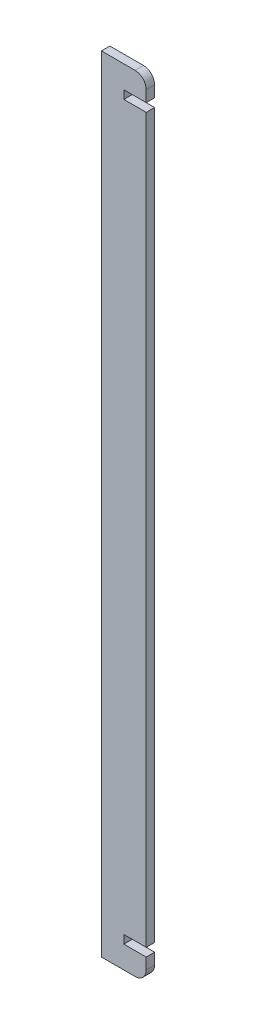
ISO-10303-21;
HEADER;
FILE_DESCRIPTION(('STEP AP214'),'2;1');
FILE_NAME('part.step','',(''),(''),'','','');
FILE_SCHEMA(('AUTOMOTIVE_DESIGN { 1 0 10303 214 1 1 1 1 }'));
ENDSEC;
DATA;
#1=APPLICATION_CONTEXT('core data for automotive mechanical design processes');
#2=APPLICATION_PROTOCOL_DEFINITION('international standard','automotive_design',2000,#1);
#3=PRODUCT_CONTEXT('',#1,'mechanical');
#4=PRODUCT('Part','Part','',(#3));
#5=PRODUCT_RELATED_PRODUCT_CATEGORY('part','',(#4));
#6=PRODUCT_DEFINITION_FORMATION('','',#4);
#7=PRODUCT_DEFINITION_CONTEXT('part definition',#1,'design');
#8=PRODUCT_DEFINITION('design','',#6,#7);
#9=PRODUCT_DEFINITION_SHAPE('','',#8);
#10=(LENGTH_UNIT() NAMED_UNIT(*) SI_UNIT(.MILLI.,.METRE.));
#11=(NAMED_UNIT(*) PLANE_ANGLE_UNIT() SI_UNIT($,.RADIAN.));
#12=(NAMED_UNIT(*) SI_UNIT($,.STERADIAN.) SOLID_ANGLE_UNIT());
#13=UNCERTAINTY_MEASURE_WITH_UNIT(LENGTH_MEASURE(1.E-05),#10,'distance_accuracy_value','');
#14=(GEOMETRIC_REPRESENTATION_CONTEXT(3) GLOBAL_UNCERTAINTY_ASSIGNED_CONTEXT((#13)) GLOBAL_UNIT_ASSIGNED_CONTEXT((#10,
#11,#12)) REPRESENTATION_CONTEXT('',''));
#15=CARTESIAN_POINT('',(0.,0.,0.));
#16=DIRECTION('',(0.,0.,1.));
#17=DIRECTION('',(1.,0.,0.));
#18=AXIS2_PLACEMENT_3D('',#15,#16,#17);
#19=CARTESIAN_POINT('',(50.7999999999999,889.,19.05));
#20=DIRECTION('',(1.,0.,0.));
#21=DIRECTION('',(0.,1.,0.));
#22=AXIS2_PLACEMENT_3D('',#19,#20,#21);
#23=PLANE('',#22);
#24=DIRECTION('',(0.,-1.,0.));
#25=VECTOR('',#24,1.);
#26=CARTESIAN_POINT('',(50.7999999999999,889.,19.05));
#27=LINE('',#26,#25);
#28=CARTESIAN_POINT('',(50.7999999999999,-838.2,19.05));
#29=VERTEX_POINT('',#28);
#30=CARTESIAN_POINT('',(50.8000000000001,-863.6,19.05));
#31=VERTEX_POINT('',#30);
#32=EDGE_CURVE('E156',#29,#31,#27,.T.);
#33=ORIENTED_EDGE('',*,*,#32,.T.);
#34=DIRECTION('',(0.,0.,-1.));
#35=VECTOR('',#34,1.);
#36=CARTESIAN_POINT('',(50.8000000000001,-863.6,0.));
#37=LINE('',#36,#35);
#38=CARTESIAN_POINT('',(50.8000000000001,-863.6,0.));
#39=VERTEX_POINT('',#38);
#40=EDGE_CURVE('E41',#31,#39,#37,.T.);
#41=ORIENTED_EDGE('',*,*,#40,.T.);
#42=DIRECTION('',(0.,-1.,0.));
#43=VECTOR('',#42,1.);
#44=CARTESIAN_POINT('',(50.7999999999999,889.,0.));
#45=LINE('',#44,#43);
#46=CARTESIAN_POINT('',(50.7999999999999,-838.2,0.));
#47=VERTEX_POINT('',#46);
#48=EDGE_CURVE('E213',#47,#39,#45,.T.);
#49=ORIENTED_EDGE('',*,*,#48,.F.);
#50=DIRECTION('',(0.,0.,-1.));
#51=VECTOR('',#50,1.);
#52=CARTESIAN_POINT('',(50.7999999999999,-838.2,19.05));
#53=LINE('',#52,#51);
#54=EDGE_CURVE('E165',#29,#47,#53,.T.);
#55=ORIENTED_EDGE('',*,*,#54,.F.);
#56=EDGE_LOOP('',(#33,#41,#49,#55));
#57=FACE_BOUND('',#56,.T.);
#58=ADVANCED_FACE('F33',(#57),#23,.T.);
#59=CARTESIAN_POINT('',(50.7999999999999,863.6,0.));
#60=VERTEX_POINT('',#59);
#61=CARTESIAN_POINT('',(50.7999999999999,838.2,0.));
#62=VERTEX_POINT('',#61);
#63=EDGE_CURVE('E214',#60,#62,#45,.T.);
#64=ORIENTED_EDGE('',*,*,#63,.F.);
#65=DIRECTION('',(0.,0.,-1.));
#66=VECTOR('',#65,1.);
#67=CARTESIAN_POINT('',(50.7999999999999,863.6,19.05));
#68=LINE('',#67,#66);
#69=CARTESIAN_POINT('',(50.7999999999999,863.6,19.05));
#70=VERTEX_POINT('',#69);
#71=EDGE_CURVE('E231',#60,#70,#68,.F.);
#72=ORIENTED_EDGE('',*,*,#71,.T.);
#73=CARTESIAN_POINT('',(50.7999999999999,838.2,19.05));
#74=VERTEX_POINT('',#73);
#75=EDGE_CURVE('E203',#70,#74,#27,.T.);
#76=ORIENTED_EDGE('',*,*,#75,.T.);
#77=DIRECTION('',(0.,0.,-1.));
#78=VECTOR('',#77,1.);
#79=CARTESIAN_POINT('',(50.7999999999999,838.2,19.05));
#80=LINE('',#79,#78);
#81=EDGE_CURVE('E190',#74,#62,#80,.T.);
#82=ORIENTED_EDGE('',*,*,#81,.T.);
#83=EDGE_LOOP('',(#64,#72,#76,#82));
#84=FACE_BOUND('',#83,.T.);
#85=ADVANCED_FACE('F288',(#84),#23,.T.);
#86=CARTESIAN_POINT('',(-50.8000000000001,889.,19.05));
#87=DIRECTION('',(0.,1.,0.));
#88=DIRECTION('',(0.,0.,1.));
#89=AXIS2_PLACEMENT_3D('',#86,#87,#88);
#90=PLANE('',#89);
#91=DIRECTION('',(1.,0.,0.));
#92=VECTOR('',#91,1.);
#93=CARTESIAN_POINT('',(-50.8000000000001,889.,19.05));
#94=LINE('',#93,#92);
#95=CARTESIAN_POINT('',(-50.8000000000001,889.,19.05));
#96=VERTEX_POINT('',#95);
#97=CARTESIAN_POINT('',(25.3999999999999,889.,19.05));
#98=VERTEX_POINT('',#97);
#99=EDGE_CURVE('E199',#96,#98,#94,.T.);
#100=ORIENTED_EDGE('',*,*,#99,.T.);
#101=DIRECTION('',(0.,0.,-1.));
#102=VECTOR('',#101,1.);
#103=CARTESIAN_POINT('',(25.3999999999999,889.,19.05));
#104=LINE('',#103,#102);
#105=CARTESIAN_POINT('',(25.3999999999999,889.,0.));
#106=VERTEX_POINT('',#105);
#107=EDGE_CURVE('E222',#98,#106,#104,.T.);
#108=ORIENTED_EDGE('',*,*,#107,.T.);
#109=DIRECTION('',(1.,0.,0.));
#110=VECTOR('',#109,1.);
#111=CARTESIAN_POINT('',(-50.8000000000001,889.,0.));
#112=LINE('',#111,#110);
#113=CARTESIAN_POINT('',(-50.8000000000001,889.,0.));
#114=VERTEX_POINT('',#113);
#115=EDGE_CURVE('E193',#114,#106,#112,.T.);
#116=ORIENTED_EDGE('',*,*,#115,.F.);
#117=DIRECTION('',(0.,0.,-1.));
#118=VECTOR('',#117,1.);
#119=CARTESIAN_POINT('',(-50.8000000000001,889.,19.05));
#120=LINE('',#119,#118);
#121=EDGE_CURVE('E220',#96,#114,#120,.T.);
#122=ORIENTED_EDGE('',*,*,#121,.F.);
#123=EDGE_LOOP('',(#100,#108,#116,#122));
#124=FACE_BOUND('',#123,.T.);
#125=ADVANCED_FACE('F275',(#124),#90,.T.);
#126=CARTESIAN_POINT('',(-50.8000000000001,889.,19.05));
#127=DIRECTION('',(1.,0.,0.));
#128=DIRECTION('',(0.,1.,0.));
#129=AXIS2_PLACEMENT_3D('',#126,#127,#128);
#130=PLANE('',#129);
#131=DIRECTION('',(0.,-1.,0.));
#132=VECTOR('',#131,1.);
#133=CARTESIAN_POINT('',(-50.8000000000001,889.,0.));
#134=LINE('',#133,#132);
#135=CARTESIAN_POINT('',(-50.7999999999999,-889.,0.));
#136=VERTEX_POINT('',#135);
#137=EDGE_CURVE('E202',#114,#136,#134,.T.);
#138=ORIENTED_EDGE('',*,*,#137,.T.);
#139=DIRECTION('',(0.,0.,-1.));
#140=VECTOR('',#139,1.);
#141=CARTESIAN_POINT('',(-50.7999999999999,-889.,19.05));
#142=LINE('',#141,#140);
#143=CARTESIAN_POINT('',(-50.7999999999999,-889.,19.05));
#144=VERTEX_POINT('',#143);
#145=EDGE_CURVE('E210',#144,#136,#142,.T.);
#146=ORIENTED_EDGE('',*,*,#145,.F.);
#147=DIRECTION('',(0.,-1.,0.));
#148=VECTOR('',#147,1.);
#149=CARTESIAN_POINT('',(-50.8000000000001,889.,19.05));
#150=LINE('',#149,#148);
#151=EDGE_CURVE('E208',#96,#144,#150,.T.);
#152=ORIENTED_EDGE('',*,*,#151,.F.);
#153=ORIENTED_EDGE('',*,*,#121,.T.);
#154=EDGE_LOOP('',(#138,#146,#152,#153));
#155=FACE_BOUND('',#154,.T.);
#156=ADVANCED_FACE('F280',(#155),#130,.F.);
#157=CARTESIAN_POINT('',(-50.7999999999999,-889.,19.05));
#158=DIRECTION('',(0.,1.,0.));
#159=DIRECTION('',(0.,0.,1.));
#160=AXIS2_PLACEMENT_3D('',#157,#158,#159);
#161=PLANE('',#160);
#162=DIRECTION('',(1.,0.,0.));
#163=VECTOR('',#162,1.);
#164=CARTESIAN_POINT('',(-50.7999999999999,-889.,0.));
#165=LINE('',#164,#163);
#166=CARTESIAN_POINT('',(25.4000000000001,-889.,0.));
#167=VERTEX_POINT('',#166);
#168=EDGE_CURVE('E216',#136,#167,#165,.T.);
#169=ORIENTED_EDGE('',*,*,#168,.T.);
#170=DIRECTION('',(0.,0.,-1.));
#171=VECTOR('',#170,1.);
#172=CARTESIAN_POINT('',(25.4000000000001,-889.,19.05));
#173=LINE('',#172,#171);
#174=CARTESIAN_POINT('',(25.4000000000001,-889.,19.05));
#175=VERTEX_POINT('',#174);
#176=EDGE_CURVE('E11',#167,#175,#173,.F.);
#177=ORIENTED_EDGE('',*,*,#176,.T.);
#178=DIRECTION('',(1.,0.,0.));
#179=VECTOR('',#178,1.);
#180=CARTESIAN_POINT('',(-50.7999999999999,-889.,19.05));
#181=LINE('',#180,#179);
#182=EDGE_CURVE('E205',#144,#175,#181,.T.);
#183=ORIENTED_EDGE('',*,*,#182,.F.);
#184=ORIENTED_EDGE('',*,*,#145,.T.);
#185=EDGE_LOOP('',(#169,#177,#183,#184));
#186=FACE_BOUND('',#185,.T.);
#187=ADVANCED_FACE('F282',(#186),#161,.F.);
#188=DIRECTION('',(0.,0.,-1.));
#189=VECTOR('',#188,1.);
#190=CARTESIAN_POINT('',(50.7999999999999,-819.15,19.05));
#191=LINE('',#190,#189);
#192=CARTESIAN_POINT('',(50.7999999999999,-819.15,19.05));
#193=VERTEX_POINT('',#192);
#194=CARTESIAN_POINT('',(50.7999999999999,-819.15,0.));
#195=VERTEX_POINT('',#194);
#196=EDGE_CURVE('E168',#193,#195,#191,.T.);
#197=ORIENTED_EDGE('',*,*,#196,.T.);
#198=CARTESIAN_POINT('',(50.7999999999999,819.15,0.));
#199=VERTEX_POINT('',#198);
#200=EDGE_CURVE('E217',#199,#195,#45,.T.);
#201=ORIENTED_EDGE('',*,*,#200,.F.);
#202=DIRECTION('',(0.,0.,-1.));
#203=VECTOR('',#202,1.);
#204=CARTESIAN_POINT('',(50.7999999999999,819.15,19.05));
#205=LINE('',#204,#203);
#206=CARTESIAN_POINT('',(50.7999999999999,819.15,19.05));
#207=VERTEX_POINT('',#206);
#208=EDGE_CURVE('E182',#207,#199,#205,.T.);
#209=ORIENTED_EDGE('',*,*,#208,.F.);
#210=EDGE_CURVE('E206',#207,#193,#27,.T.);
#211=ORIENTED_EDGE('',*,*,#210,.T.);
#212=EDGE_LOOP('',(#197,#201,#209,#211));
#213=FACE_BOUND('',#212,.T.);
#214=ADVANCED_FACE('F251',(#213),#23,.T.);
#215=CARTESIAN_POINT('',(0.,0.,19.05));
#216=DIRECTION('',(0.,0.,-1.));
#217=DIRECTION('',(-1.,0.,0.));
#218=AXIS2_PLACEMENT_3D('',#215,#216,#217);
#219=PLANE('',#218);
#220=ORIENTED_EDGE('',*,*,#75,.F.);
#221=CARTESIAN_POINT('',(25.3999999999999,863.6,19.05));
#222=DIRECTION('',(0.,0.,-1.));
#223=DIRECTION('',(-1.,0.,0.));
#224=AXIS2_PLACEMENT_3D('',#221,#222,#223);
#225=CIRCLE('',#224,25.4);
#226=EDGE_CURVE('E234',#70,#98,#225,.F.);
#227=ORIENTED_EDGE('',*,*,#226,.T.);
#228=ORIENTED_EDGE('',*,*,#99,.F.);
#229=ORIENTED_EDGE('',*,*,#151,.T.);
#230=ORIENTED_EDGE('',*,*,#182,.T.);
#231=CARTESIAN_POINT('',(25.4000000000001,-863.6,19.05));
#232=DIRECTION('',(0.,0.,-1.));
#233=DIRECTION('',(-1.,0.,0.));
#234=AXIS2_PLACEMENT_3D('',#231,#232,#233);
#235=CIRCLE('',#234,25.4);
#236=EDGE_CURVE('E53',#175,#31,#235,.F.);
#237=ORIENTED_EDGE('',*,*,#236,.T.);
#238=ORIENTED_EDGE('',*,*,#32,.F.);
#239=DIRECTION('',(-1.,0.,0.));
#240=VECTOR('',#239,1.);
#241=CARTESIAN_POINT('',(50.7999999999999,-838.2,19.05));
#242=LINE('',#241,#240);
#243=CARTESIAN_POINT('',(-1.17961196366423E-13,-838.2,19.05));
#244=VERTEX_POINT('',#243);
#245=EDGE_CURVE('E138',#29,#244,#242,.T.);
#246=ORIENTED_EDGE('',*,*,#245,.T.);
#247=DIRECTION('',(0.,1.,0.));
#248=VECTOR('',#247,1.);
#249=CARTESIAN_POINT('',(-1.17961196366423E-13,-838.2,19.05));
#250=LINE('',#249,#248);
#251=CARTESIAN_POINT('',(-1.20294148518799E-13,-819.15,19.05));
#252=VERTEX_POINT('',#251);
#253=EDGE_CURVE('E149',#244,#252,#250,.T.);
#254=ORIENTED_EDGE('',*,*,#253,.T.);
#255=DIRECTION('',(1.,0.,0.));
#256=VECTOR('',#255,1.);
#257=CARTESIAN_POINT('',(50.7999999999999,-819.15,19.05));
#258=LINE('',#257,#256);
#259=EDGE_CURVE('E146',#252,#193,#258,.T.);
#260=ORIENTED_EDGE('',*,*,#259,.T.);
#261=ORIENTED_EDGE('',*,*,#210,.F.);
#262=DIRECTION('',(-1.,0.,0.));
#263=VECTOR('',#262,1.);
#264=CARTESIAN_POINT('',(50.7999999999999,819.15,19.05));
#265=LINE('',#264,#263);
#266=CARTESIAN_POINT('',(-1.20294148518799E-13,819.15,19.05));
#267=VERTEX_POINT('',#266);
#268=EDGE_CURVE('E172',#207,#267,#265,.T.);
#269=ORIENTED_EDGE('',*,*,#268,.T.);
#270=DIRECTION('',(0.,1.,0.));
#271=VECTOR('',#270,1.);
#272=CARTESIAN_POINT('',(-1.17961196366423E-13,838.2,19.05));
#273=LINE('',#272,#271);
#274=CARTESIAN_POINT('',(-1.17961196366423E-13,838.2,19.05));
#275=VERTEX_POINT('',#274);
#276=EDGE_CURVE('E175',#267,#275,#273,.T.);
#277=ORIENTED_EDGE('',*,*,#276,.T.);
#278=DIRECTION('',(1.,0.,0.));
#279=VECTOR('',#278,1.);
#280=CARTESIAN_POINT('',(50.7999999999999,838.2,19.05));
#281=LINE('',#280,#279);
#282=EDGE_CURVE('E179',#275,#74,#281,.T.);
#283=ORIENTED_EDGE('',*,*,#282,.T.);
#284=EDGE_LOOP('',(#220,#227,#228,#229,#230,#237,#238,#246,#254,#260,#261,#269,#277,#283));
#285=FACE_BOUND('',#284,.T.);
#286=ADVANCED_FACE('F155',(#285),#219,.F.);
#287=CARTESIAN_POINT('',(0.,0.,0.));
#288=DIRECTION('',(0.,0.,-1.));
#289=DIRECTION('',(-1.,0.,0.));
#290=AXIS2_PLACEMENT_3D('',#287,#288,#289);
#291=PLANE('',#290);
#292=ORIENTED_EDGE('',*,*,#115,.T.);
#293=CARTESIAN_POINT('',(25.3999999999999,863.6,0.));
#294=DIRECTION('',(0.,0.,-1.));
#295=DIRECTION('',(-1.,0.,0.));
#296=AXIS2_PLACEMENT_3D('',#293,#294,#295);
#297=CIRCLE('',#296,25.4);
#298=EDGE_CURVE('E229',#106,#60,#297,.T.);
#299=ORIENTED_EDGE('',*,*,#298,.T.);
#300=ORIENTED_EDGE('',*,*,#63,.T.);
#301=DIRECTION('',(1.,0.,0.));
#302=VECTOR('',#301,1.);
#303=CARTESIAN_POINT('',(50.7999999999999,838.2,0.));
#304=LINE('',#303,#302);
#305=CARTESIAN_POINT('',(-1.17961196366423E-13,838.2,0.));
#306=VERTEX_POINT('',#305);
#307=EDGE_CURVE('E176',#306,#62,#304,.T.);
#308=ORIENTED_EDGE('',*,*,#307,.F.);
#309=DIRECTION('',(0.,1.,0.));
#310=VECTOR('',#309,1.);
#311=CARTESIAN_POINT('',(-1.17961196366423E-13,838.2,0.));
#312=LINE('',#311,#310);
#313=CARTESIAN_POINT('',(-1.20294148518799E-13,819.15,0.));
#314=VERTEX_POINT('',#313);
#315=EDGE_CURVE('E185',#314,#306,#312,.T.);
#316=ORIENTED_EDGE('',*,*,#315,.F.);
#317=DIRECTION('',(-1.,0.,0.));
#318=VECTOR('',#317,1.);
#319=CARTESIAN_POINT('',(50.7999999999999,819.15,0.));
#320=LINE('',#319,#318);
#321=EDGE_CURVE('E167',#199,#314,#320,.T.);
#322=ORIENTED_EDGE('',*,*,#321,.F.);
#323=ORIENTED_EDGE('',*,*,#200,.T.);
#324=DIRECTION('',(1.,0.,0.));
#325=VECTOR('',#324,1.);
#326=CARTESIAN_POINT('',(50.7999999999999,-819.15,0.));
#327=LINE('',#326,#325);
#328=CARTESIAN_POINT('',(-1.20294148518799E-13,-819.15,0.));
#329=VERTEX_POINT('',#328);
#330=EDGE_CURVE('E157',#329,#195,#327,.T.);
#331=ORIENTED_EDGE('',*,*,#330,.F.);
#332=DIRECTION('',(0.,1.,0.));
#333=VECTOR('',#332,1.);
#334=CARTESIAN_POINT('',(-1.17961196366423E-13,-838.2,0.));
#335=LINE('',#334,#333);
#336=CARTESIAN_POINT('',(-1.17961196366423E-13,-838.2,0.));
#337=VERTEX_POINT('',#336);
#338=EDGE_CURVE('E159',#337,#329,#335,.T.);
#339=ORIENTED_EDGE('',*,*,#338,.F.);
#340=DIRECTION('',(-1.,0.,0.));
#341=VECTOR('',#340,1.);
#342=CARTESIAN_POINT('',(50.7999999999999,-838.2,0.));
#343=LINE('',#342,#341);
#344=EDGE_CURVE('E141',#47,#337,#343,.T.);
#345=ORIENTED_EDGE('',*,*,#344,.F.);
#346=ORIENTED_EDGE('',*,*,#48,.T.);
#347=CARTESIAN_POINT('',(25.4000000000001,-863.6,0.));
#348=DIRECTION('',(0.,0.,-1.));
#349=DIRECTION('',(-1.,0.,0.));
#350=AXIS2_PLACEMENT_3D('',#347,#348,#349);
#351=CIRCLE('',#350,25.4);
#352=EDGE_CURVE('E227',#39,#167,#351,.T.);
#353=ORIENTED_EDGE('',*,*,#352,.T.);
#354=ORIENTED_EDGE('',*,*,#168,.F.);
#355=ORIENTED_EDGE('',*,*,#137,.F.);
#356=EDGE_LOOP('',(#292,#299,#300,#308,#316,#322,#323,#331,#339,#345,#346,#353,#354,#355));
#357=FACE_BOUND('',#356,.T.);
#358=ADVANCED_FACE('F242',(#357),#291,.T.);
#359=CARTESIAN_POINT('',(50.7999999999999,838.2,19.05));
#360=DIRECTION('',(0.,1.,0.));
#361=DIRECTION('',(0.,0.,1.));
#362=AXIS2_PLACEMENT_3D('',#359,#360,#361);
#363=PLANE('',#362);
#364=ORIENTED_EDGE('',*,*,#307,.T.);
#365=ORIENTED_EDGE('',*,*,#81,.F.);
#366=ORIENTED_EDGE('',*,*,#282,.F.);
#367=DIRECTION('',(0.,0.,-1.));
#368=VECTOR('',#367,1.);
#369=CARTESIAN_POINT('',(-1.17961196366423E-13,838.2,19.05));
#370=LINE('',#369,#368);
#371=EDGE_CURVE('E194',#275,#306,#370,.T.);
#372=ORIENTED_EDGE('',*,*,#371,.T.);
#373=EDGE_LOOP('',(#364,#365,#366,#372));
#374=FACE_BOUND('',#373,.T.);
#375=ADVANCED_FACE('F265',(#374),#363,.F.);
#376=CARTESIAN_POINT('',(-1.17961196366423E-13,838.2,19.05));
#377=DIRECTION('',(-1.,0.,0.));
#378=DIRECTION('',(0.,-1.,0.));
#379=AXIS2_PLACEMENT_3D('',#376,#377,#378);
#380=PLANE('',#379);
#381=ORIENTED_EDGE('',*,*,#315,.T.);
#382=ORIENTED_EDGE('',*,*,#371,.F.);
#383=ORIENTED_EDGE('',*,*,#276,.F.);
#384=DIRECTION('',(0.,0.,-1.));
#385=VECTOR('',#384,1.);
#386=CARTESIAN_POINT('',(-1.20294148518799E-13,819.15,19.05));
#387=LINE('',#386,#385);
#388=EDGE_CURVE('E196',#267,#314,#387,.T.);
#389=ORIENTED_EDGE('',*,*,#388,.T.);
#390=EDGE_LOOP('',(#381,#382,#383,#389));
#391=FACE_BOUND('',#390,.T.);
#392=ADVANCED_FACE('F260',(#391),#380,.F.);
#393=CARTESIAN_POINT('',(50.7999999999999,819.15,19.05));
#394=DIRECTION('',(0.,-1.,0.));
#395=DIRECTION('',(0.,0.,-1.));
#396=AXIS2_PLACEMENT_3D('',#393,#394,#395);
#397=PLANE('',#396);
#398=ORIENTED_EDGE('',*,*,#321,.T.);
#399=ORIENTED_EDGE('',*,*,#388,.F.);
#400=ORIENTED_EDGE('',*,*,#268,.F.);
#401=ORIENTED_EDGE('',*,*,#208,.T.);
#402=EDGE_LOOP('',(#398,#399,#400,#401));
#403=FACE_BOUND('',#402,.T.);
#404=ADVANCED_FACE('F258',(#403),#397,.F.);
#405=CARTESIAN_POINT('',(50.7999999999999,-838.2,19.05));
#406=DIRECTION('',(0.,-1.,0.));
#407=DIRECTION('',(0.,0.,-1.));
#408=AXIS2_PLACEMENT_3D('',#405,#406,#407);
#409=PLANE('',#408);
#410=ORIENTED_EDGE('',*,*,#344,.T.);
#411=DIRECTION('',(0.,0.,-1.));
#412=VECTOR('',#411,1.);
#413=CARTESIAN_POINT('',(-1.17961196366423E-13,-838.2,19.05));
#414=LINE('',#413,#412);
#415=EDGE_CURVE('E134',#244,#337,#414,.T.);
#416=ORIENTED_EDGE('',*,*,#415,.F.);
#417=ORIENTED_EDGE('',*,*,#245,.F.);
#418=ORIENTED_EDGE('',*,*,#54,.T.);
#419=EDGE_LOOP('',(#410,#416,#417,#418));
#420=FACE_BOUND('',#419,.T.);
#421=ADVANCED_FACE('F136',(#420),#409,.F.);
#422=CARTESIAN_POINT('',(50.7999999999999,-819.15,19.05));
#423=DIRECTION('',(0.,1.,0.));
#424=DIRECTION('',(0.,0.,1.));
#425=AXIS2_PLACEMENT_3D('',#422,#423,#424);
#426=PLANE('',#425);
#427=ORIENTED_EDGE('',*,*,#330,.T.);
#428=ORIENTED_EDGE('',*,*,#196,.F.);
#429=ORIENTED_EDGE('',*,*,#259,.F.);
#430=DIRECTION('',(0.,0.,-1.));
#431=VECTOR('',#430,1.);
#432=CARTESIAN_POINT('',(-1.20294148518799E-13,-819.15,19.05));
#433=LINE('',#432,#431);
#434=EDGE_CURVE('E145',#252,#329,#433,.T.);
#435=ORIENTED_EDGE('',*,*,#434,.T.);
#436=EDGE_LOOP('',(#427,#428,#429,#435));
#437=FACE_BOUND('',#436,.T.);
#438=ADVANCED_FACE('F255',(#437),#426,.F.);
#439=CARTESIAN_POINT('',(-1.17961196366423E-13,-838.2,19.05));
#440=DIRECTION('',(-1.,0.,0.));
#441=DIRECTION('',(0.,-1.,0.));
#442=AXIS2_PLACEMENT_3D('',#439,#440,#441);
#443=PLANE('',#442);
#444=ORIENTED_EDGE('',*,*,#338,.T.);
#445=ORIENTED_EDGE('',*,*,#434,.F.);
#446=ORIENTED_EDGE('',*,*,#253,.F.);
#447=ORIENTED_EDGE('',*,*,#415,.T.);
#448=EDGE_LOOP('',(#444,#445,#446,#447));
#449=FACE_BOUND('',#448,.T.);
#450=ADVANCED_FACE('F150',(#449),#443,.F.);
#451=CARTESIAN_POINT('',(25.3999999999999,863.6,19.05));
#452=DIRECTION('',(0.,0.,-1.));
#453=DIRECTION('',(-1.,0.,0.));
#454=AXIS2_PLACEMENT_3D('',#451,#452,#453);
#455=CYLINDRICAL_SURFACE('',#454,25.4);
#456=ORIENTED_EDGE('',*,*,#226,.F.);
#457=ORIENTED_EDGE('',*,*,#71,.F.);
#458=ORIENTED_EDGE('',*,*,#298,.F.);
#459=ORIENTED_EDGE('',*,*,#107,.F.);
#460=EDGE_LOOP('',(#456,#457,#458,#459));
#461=FACE_BOUND('',#460,.T.);
#462=ADVANCED_FACE('F272',(#461),#455,.T.);
#463=CARTESIAN_POINT('',(25.4000000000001,-863.6,19.05));
#464=DIRECTION('',(0.,0.,1.));
#465=DIRECTION('',(1.,0.,0.));
#466=AXIS2_PLACEMENT_3D('',#463,#464,#465);
#467=CYLINDRICAL_SURFACE('',#466,25.4);
#468=ORIENTED_EDGE('',*,*,#236,.F.);
#469=ORIENTED_EDGE('',*,*,#176,.F.);
#470=ORIENTED_EDGE('',*,*,#352,.F.);
#471=ORIENTED_EDGE('',*,*,#40,.F.);
#472=EDGE_LOOP('',(#468,#469,#470,#471));
#473=FACE_BOUND('',#472,.T.);
#474=ADVANCED_FACE('F35',(#473),#467,.T.);
#475=CLOSED_SHELL('',(#58,#85,#125,#156,#187,#214,#286,#358,#375,#392,#404,#421,#438,#450,#462,#474));
#476=MANIFOLD_SOLID_BREP('B2',#475);
#477=ADVANCED_BREP_SHAPE_REPRESENTATION('',(#18,#476),#14);
#478=SHAPE_DEFINITION_REPRESENTATION(#9,#477);
ENDSEC;
END-ISO-10303-21;
